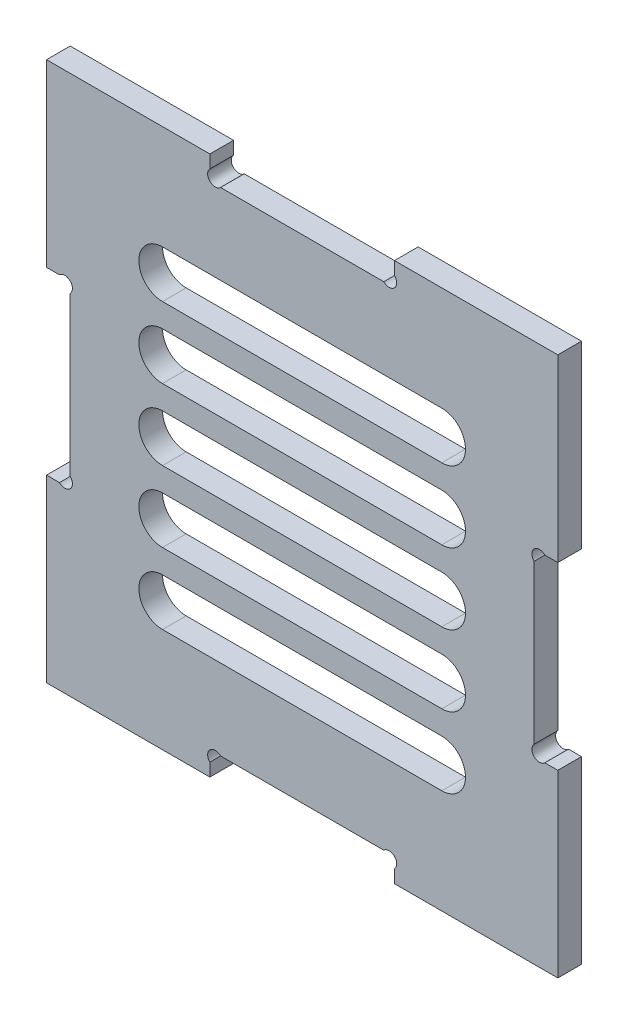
from build123d import *

# Parameters (mm, degrees)
BOSS_EXTRU_1_DEPTH = 5


with BuildPart() as part:
    # Esquisse1 → Boss.-Extru.1 (new body)
    with BuildSketch(Plane.XY):
        with BuildLine():
            Line((73.509303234, -37.445427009), (76.246561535, -37.445427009))
            Line((76.246561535, -37.445427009), (76.246561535, -75.445427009))
            Line((76.246561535, -75.445427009), (41.746561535, -75.445427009))
            Line((41.746561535, -75.445427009), (41.746561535, -72.708168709))
            ThreePointArc((41.746561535, -72.708168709), (41.746561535, -70.445427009), (39.483819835, -70.445427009))
            Line((39.483819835, -70.445427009), (5.009303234, -70.445427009))
            ThreePointArc((5.009303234, -70.445427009), (2.746561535, -70.445427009), (2.746561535, -72.708168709))
            Line((2.746561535, -72.708168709), (2.746561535, -75.445427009))
            Line((2.746561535, -75.445427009), (-31.753438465, -75.445427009))
            Line((-31.753438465, -75.445427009), (-31.753438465, -37.445427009))
            Line((-31.753438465, -37.445427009), (-29.016180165, -37.445427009))
            ThreePointArc((-29.016180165, -37.445427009), (-26.753438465, -37.445427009), (-26.753438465, -35.182685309))
            Line((-26.753438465, -35.182685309), (-26.753438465, -1.708168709))
            ThreePointArc((-26.753438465, -1.708168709), (-26.753438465, 0.554572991), (-29.016180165, 0.554572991))
            Line((-29.016180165, 0.554572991), (-31.753438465, 0.554572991))
            Line((-31.753438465, 0.554572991), (-31.753438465, 38.554572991))
            Line((-31.753438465, 38.554572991), (2.746561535, 38.554572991))
            Line((2.746561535, 38.554572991), (2.746561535, 35.817314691))
            ThreePointArc((2.746561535, 35.817314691), (2.746561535, 33.554572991), (5.009303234, 33.554572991))
            Line((5.009303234, 33.554572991), (39.483819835, 33.554572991))
            ThreePointArc((39.483819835, 33.554572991), (41.746561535, 33.554572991), (41.746561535, 35.817314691))
            Line((41.746561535, 35.817314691), (41.746561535, 38.554572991))
            Line((41.746561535, 38.554572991), (76.246561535, 38.554572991))
            Line((76.246561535, 38.554572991), (76.246561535, 0.554572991))
            Line((76.246561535, 0.554572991), (73.509303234, 0.554572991))
            ThreePointArc((73.509303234, 0.554572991), (71.246561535, 0.554572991), (71.246561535, -1.708168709))
            Line((71.246561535, -1.708168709), (71.246561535, -35.182685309))
            ThreePointArc((71.246561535, -35.182685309), (71.246561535, -37.445427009), (73.509303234, -37.445427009))
        make_face()
        with BuildLine():
            Line((51.746561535, -23.445427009), (-7.253438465, -23.445427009))
            ThreePointArc((-7.253438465, -23.445427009), (-12.253438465, -18.445427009), (-7.253438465, -13.445427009))
            Line((-7.253438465, -13.445427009), (51.746561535, -13.445427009))
            ThreePointArc((51.746561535, -13.445427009), (56.746561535, -18.445427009), (51.746561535, -23.445427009))
        make_face(mode=Mode.SUBTRACT)
        with BuildLine():
            Line((51.746561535, -8.445427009), (-7.253438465, -8.445427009))
            ThreePointArc((-7.253438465, -8.445427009), (-12.253438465, -3.445427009), (-7.253438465, 1.554572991))
            Line((-7.253438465, 1.554572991), (51.746561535, 1.554572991))
            ThreePointArc((51.746561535, 1.554572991), (56.746561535, -3.445427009), (51.746561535, -8.445427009))
        make_face(mode=Mode.SUBTRACT)
        with BuildLine():
            Line((51.746561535, 6.554572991), (-7.253438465, 6.554572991))
            ThreePointArc((-7.253438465, 6.554572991), (-12.253438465, 11.554572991), (-7.253438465, 16.554572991))
            Line((-7.253438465, 16.554572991), (51.746561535, 16.554572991))
            ThreePointArc((51.746561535, 16.554572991), (56.746561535, 11.554572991), (51.746561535, 6.554572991))
        make_face(mode=Mode.SUBTRACT)
        with BuildLine():
            Line((51.746561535, -28.445427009), (-7.253438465, -28.445427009))
            ThreePointArc((-7.253438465, -28.445427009), (-12.253438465, -33.445427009), (-7.253438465, -38.445427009))
            Line((-7.253438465, -38.445427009), (51.746561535, -38.445427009))
            ThreePointArc((51.746561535, -38.445427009), (56.746561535, -33.445427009), (51.746561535, -28.445427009))
        make_face(mode=Mode.SUBTRACT)
        with BuildLine():
            Line((51.746561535, -43.445427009), (-7.253438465, -43.445427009))
            ThreePointArc((-7.253438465, -43.445427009), (-12.253438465, -48.445427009), (-7.253438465, -53.445427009))
            Line((-7.253438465, -53.445427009), (51.746561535, -53.445427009))
            ThreePointArc((51.746561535, -53.445427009), (56.746561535, -48.445427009), (51.746561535, -43.445427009))
        make_face(mode=Mode.SUBTRACT)
    extrude(amount=BOSS_EXTRU_1_DEPTH)


solid = part.part
